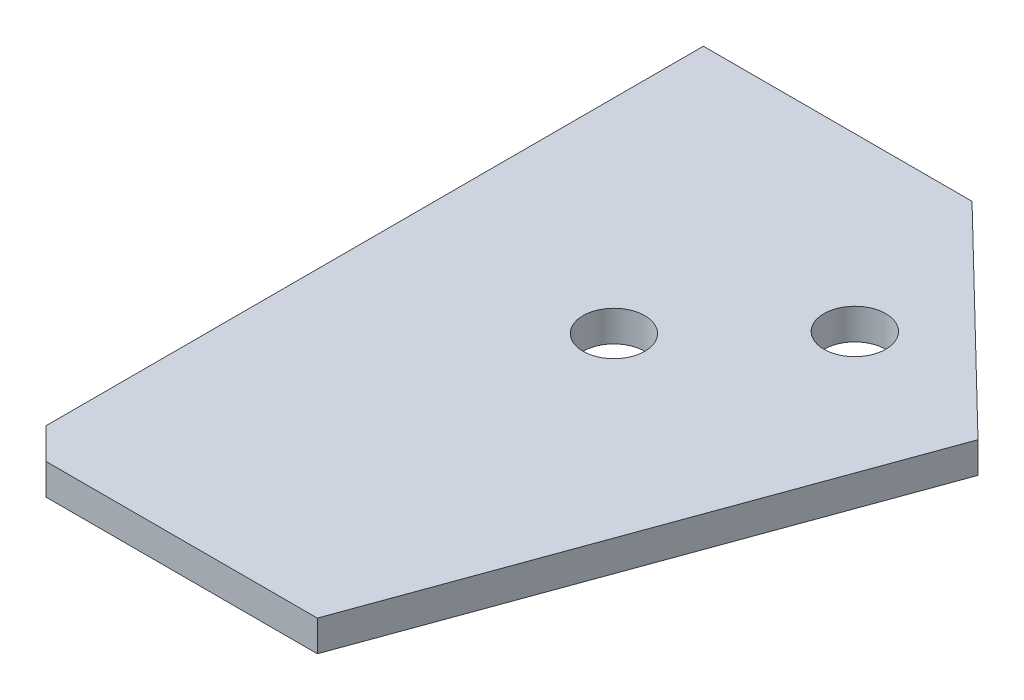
from build123d import *

# Parameters (mm, degrees)
BOSS_EXTRUDE1_DEPTH    = 6.35
F_1_1_DIAMETER_HOLE1_D = 25.4
CHAMFER2_SIZE          = 12.7


with BuildPart() as part:
    # Sketch1 → Boss-Extrude1 (new, symmetric)
    with BuildSketch(Plane(origin=(0, 0, 0), x_dir=(1, 0, 0), z_dir=(0, 1, 0))):
        Polygon((124.2, 0), (196.451283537, 199.207542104), (110.379713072, 282.823836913), (0, 282.823836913), (0, 0), align=None)
    extrude(amount=BOSS_EXTRUDE1_DEPTH, both=True)

    # 1 _1_ Diameter Hole1 (through all)
    with Locations(Plane(origin=(0, 6.35, 0), x_dir=(-1, 0, 0), z_dir=(0, 1, 0))):
        with Locations((-132.613727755, -212.427469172), (-83.837555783, -162.219053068)):
            Hole(F_1_1_DIAMETER_HOLE1_D / 2)

    # Chamfer2
    chamfer2_edges = [part.edges().sort_by_distance(p)[0] for p in [
        (0, 0, 0),
    ]]
    chamfer(chamfer2_edges, length=CHAMFER2_SIZE)


solid = part.part
